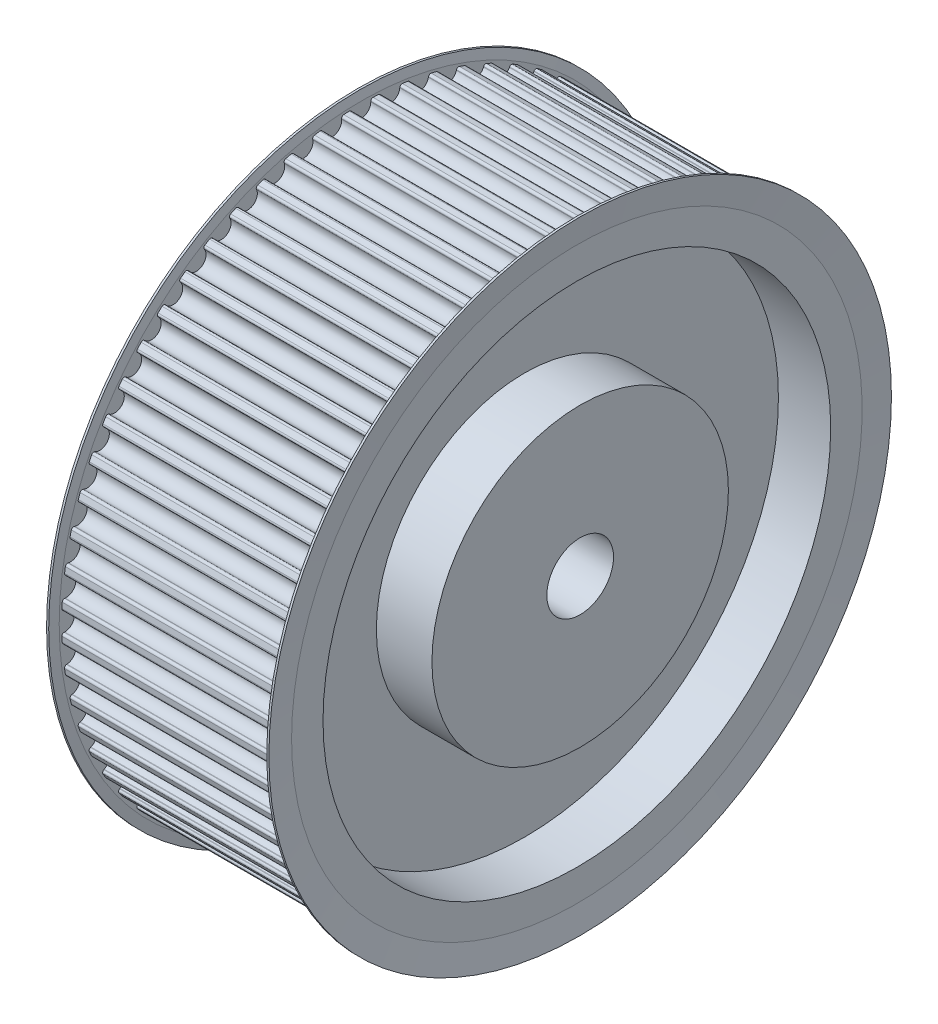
from build123d import *

# Parameters (mm, degrees)
HTD_PROFIL_START      = -58.21
HTD_PROFIL_DEPTH      = 58.21
Z_HNEZAHL_HTD_COUNT   = 64
SKIZZE7_W             = 0.895
SKIZZE7_H             = 40
VORBOHRUNG_DEPTH      = 123.52346714
VORBOHRUNG_DEPTH_BACK = 123.52346714
SKIZZE6_R             = 9
SKIZZE9_W             = 14.105
SKIZZE9_H             = 28.5


with BuildPart() as part:
    # Skizze1 → Basis (revolve)
    with BuildSketch(Plane.XY, mode=Mode.PRIVATE) as basis_sk:
        Polygon((29.105, 40), (30, 40), (30, 0), (-29.105, 0), (-29.105, 80.8), (29.105, 80.8), align=None)
    revolve(basis_sk.sketch.rotate(Axis((-29.105, 0, 0), (1, 0, 0)), 90), axis=Axis((-29.105, 0, 0), (1, 0, 0)))

    # Skizze8 → HTD-Profil (cut)
    with BuildSketch(Plane.ZY.offset(29.105).offset(HTD_PROFIL_START)):
        with BuildLine():
            Line((-2.6, 80), (-2.6, 80.136134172))
            ThreePointArc((-2.6, 80.136134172), (-2.78428621, 80.568779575), (-3.22394015, 80.735656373))
            ThreePointArc((-3.22394015, 80.735656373), (0, 80.8), (3.22394015, 80.735656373))
            ThreePointArc((3.22394015, 80.735656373), (2.78428621, 80.568779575), (2.6, 80.136134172))
            Line((2.6, 80.136134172), (2.6, 80))
            ThreePointArc((2.6, 80), (0, 77.4), (-2.6, 80))
        make_face()
    htd_profil = extrude(amount=HTD_PROFIL_DEPTH, mode=Mode.SUBTRACT)

    # Z_hnezahl HTD: HTD-Profil ×64 about axis
    z_hnezahl_htd_axis = Axis((0, 0, 0), (1, 0, 0))
    for i in range(1, Z_HNEZAHL_HTD_COUNT):
        add(htd_profil.rotate(z_hnezahl_htd_axis, i * 360 / Z_HNEZAHL_HTD_COUNT), mode=Mode.SUBTRACT)

    # Skizze7 → Rotation1 (revolve)
    with BuildSketch(Plane.XY, mode=Mode.PRIVATE) as rotation1_sk:
        Polygon((-29.105, 76.985), (-30, 84), (-29.425873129, 84), (-29.105, 81.485), align=None)
        with Locations((-29.5525, 20)):
            Rectangle(SKIZZE7_W, SKIZZE7_H)
        Polygon((29.105, 81.485), (29.105, 76.985), (30, 84), (29.425873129, 84), align=None)
    revolve(rotation1_sk.sketch.rotate(Axis((0, 0, 0), (1, 0, 0)), 90), axis=Axis((0, 0, 0), (1, 0, 0)))

    # Skizze6 → Vorbohrung (cut, two sides: drawn at the far end of the back side and taken through both)
    with BuildSketch(Plane(origin=(0, 0, 0), x_dir=(0, 0, -1), z_dir=(1, 0, 0)).offset(-VORBOHRUNG_DEPTH_BACK)):
        Circle(SKIZZE6_R)
    extrude(amount=VORBOHRUNG_DEPTH + VORBOHRUNG_DEPTH_BACK, mode=Mode.SUBTRACT)

    # Skizze9 → Schnitt (revolve, cut)
    with BuildSketch(Plane.XY, mode=Mode.PRIVATE) as schnitt_sk:
        with Locations((-22.0525, 54.25)):
            Rectangle(SKIZZE9_W, SKIZZE9_H)
        with Locations((22.0525, 54.25)):
            Rectangle(SKIZZE9_W, SKIZZE9_H)
    revolve(schnitt_sk.sketch.rotate(Axis((0, 0, 0), (1, 0, 0)), 90), axis=Axis((0, 0, 0), (1, 0, 0)), mode=Mode.SUBTRACT)


solid = part.part
